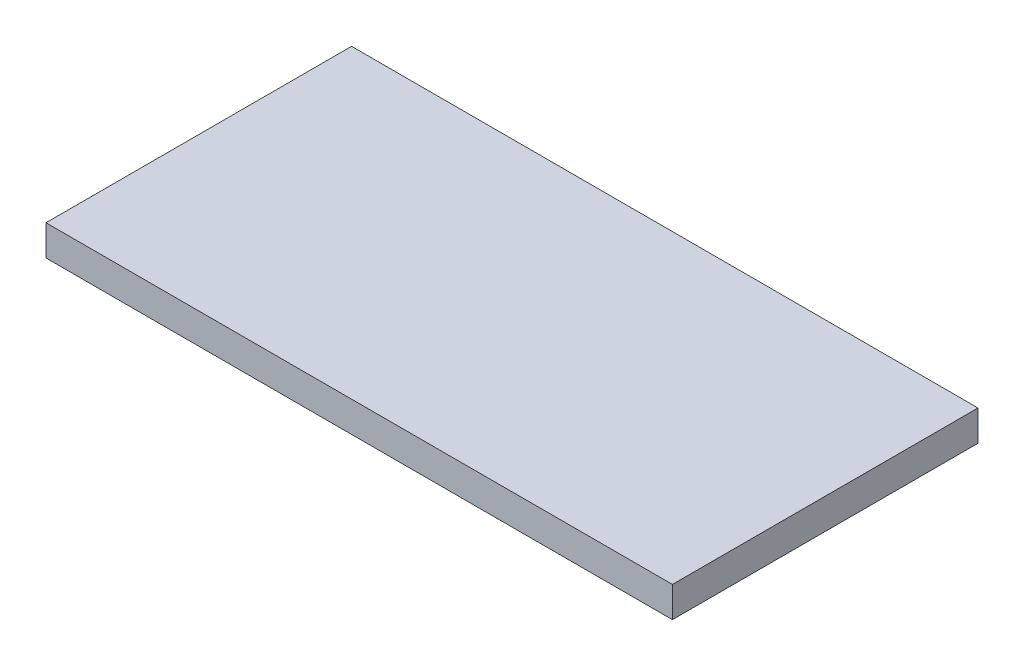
ISO-10303-21;
HEADER;
FILE_DESCRIPTION(('STEP AP214'),'2;1');
FILE_NAME('part.step','',(''),(''),'','','');
FILE_SCHEMA(('AUTOMOTIVE_DESIGN { 1 0 10303 214 1 1 1 1 }'));
ENDSEC;
DATA;
#1=APPLICATION_CONTEXT('core data for automotive mechanical design processes');
#2=APPLICATION_PROTOCOL_DEFINITION('international standard','automotive_design',2000,#1);
#3=PRODUCT_CONTEXT('',#1,'mechanical');
#4=PRODUCT('Part','Part','',(#3));
#5=PRODUCT_RELATED_PRODUCT_CATEGORY('part','',(#4));
#6=PRODUCT_DEFINITION_FORMATION('','',#4);
#7=PRODUCT_DEFINITION_CONTEXT('part definition',#1,'design');
#8=PRODUCT_DEFINITION('design','',#6,#7);
#9=PRODUCT_DEFINITION_SHAPE('','',#8);
#10=(LENGTH_UNIT() NAMED_UNIT(*) SI_UNIT(.MILLI.,.METRE.));
#11=(NAMED_UNIT(*) PLANE_ANGLE_UNIT() SI_UNIT($,.RADIAN.));
#12=(NAMED_UNIT(*) SI_UNIT($,.STERADIAN.) SOLID_ANGLE_UNIT());
#13=UNCERTAINTY_MEASURE_WITH_UNIT(LENGTH_MEASURE(1.E-05),#10,'distance_accuracy_value','');
#14=(GEOMETRIC_REPRESENTATION_CONTEXT(3) GLOBAL_UNCERTAINTY_ASSIGNED_CONTEXT((#13)) GLOBAL_UNIT_ASSIGNED_CONTEXT((#10,
#11,#12)) REPRESENTATION_CONTEXT('',''));
#15=CARTESIAN_POINT('',(0.,0.,0.));
#16=DIRECTION('',(0.,0.,1.));
#17=DIRECTION('',(1.,0.,0.));
#18=AXIS2_PLACEMENT_3D('',#15,#16,#17);
#19=CARTESIAN_POINT('',(-45.,0.,50.));
#20=DIRECTION('',(1.,0.,0.));
#21=DIRECTION('',(0.,0.,-1.));
#22=AXIS2_PLACEMENT_3D('',#19,#20,#21);
#23=PLANE('',#22);
#24=DIRECTION('',(0.,-1.,0.));
#25=VECTOR('',#24,1.);
#26=CARTESIAN_POINT('',(-45.,0.,-50.));
#27=LINE('',#26,#25);
#28=CARTESIAN_POINT('',(-45.,10.,-50.));
#29=VERTEX_POINT('',#28);
#30=CARTESIAN_POINT('',(-45.,0.,-50.));
#31=VERTEX_POINT('',#30);
#32=EDGE_CURVE('E106',#29,#31,#27,.T.);
#33=ORIENTED_EDGE('',*,*,#32,.T.);
#34=DIRECTION('',(0.,0.,-1.));
#35=VECTOR('',#34,1.);
#36=CARTESIAN_POINT('',(-45.,0.,50.));
#37=LINE('',#36,#35);
#38=CARTESIAN_POINT('',(-45.,0.,50.));
#39=VERTEX_POINT('',#38);
#40=EDGE_CURVE('E11',#39,#31,#37,.T.);
#41=ORIENTED_EDGE('',*,*,#40,.F.);
#42=DIRECTION('',(0.,-1.,0.));
#43=VECTOR('',#42,1.);
#44=CARTESIAN_POINT('',(-45.,0.,50.));
#45=LINE('',#44,#43);
#46=CARTESIAN_POINT('',(-45.,10.,50.));
#47=VERTEX_POINT('',#46);
#48=EDGE_CURVE('E94',#47,#39,#45,.T.);
#49=ORIENTED_EDGE('',*,*,#48,.F.);
#50=DIRECTION('',(0.,0.,-1.));
#51=VECTOR('',#50,1.);
#52=CARTESIAN_POINT('',(-45.,10.,50.));
#53=LINE('',#52,#51);
#54=EDGE_CURVE('E102',#47,#29,#53,.T.);
#55=ORIENTED_EDGE('',*,*,#54,.T.);
#56=EDGE_LOOP('',(#33,#41,#49,#55));
#57=FACE_BOUND('',#56,.T.);
#58=ADVANCED_FACE('F43',(#57),#23,.F.);
#59=CARTESIAN_POINT('',(-45.,0.,50.));
#60=DIRECTION('',(0.,1.,0.));
#61=DIRECTION('',(0.,0.,1.));
#62=AXIS2_PLACEMENT_3D('',#59,#60,#61);
#63=PLANE('',#62);
#64=DIRECTION('',(1.,0.,0.));
#65=VECTOR('',#64,1.);
#66=CARTESIAN_POINT('',(-45.,0.,-50.));
#67=LINE('',#66,#65);
#68=CARTESIAN_POINT('',(160.,0.,-50.));
#69=VERTEX_POINT('',#68);
#70=EDGE_CURVE('E98',#31,#69,#67,.T.);
#71=ORIENTED_EDGE('',*,*,#70,.T.);
#72=DIRECTION('',(0.,0.,-1.));
#73=VECTOR('',#72,1.);
#74=CARTESIAN_POINT('',(160.,0.,50.));
#75=LINE('',#74,#73);
#76=CARTESIAN_POINT('',(160.,0.,50.));
#77=VERTEX_POINT('',#76);
#78=EDGE_CURVE('E51',#77,#69,#75,.T.);
#79=ORIENTED_EDGE('',*,*,#78,.F.);
#80=DIRECTION('',(1.,0.,0.));
#81=VECTOR('',#80,1.);
#82=CARTESIAN_POINT('',(-45.,0.,50.));
#83=LINE('',#82,#81);
#84=EDGE_CURVE('E89',#39,#77,#83,.T.);
#85=ORIENTED_EDGE('',*,*,#84,.F.);
#86=ORIENTED_EDGE('',*,*,#40,.T.);
#87=EDGE_LOOP('',(#71,#79,#85,#86));
#88=FACE_BOUND('',#87,.T.);
#89=ADVANCED_FACE('F97',(#88),#63,.F.);
#90=CARTESIAN_POINT('',(160.,0.,50.));
#91=DIRECTION('',(-1.,0.,0.));
#92=DIRECTION('',(0.,0.,1.));
#93=AXIS2_PLACEMENT_3D('',#90,#91,#92);
#94=PLANE('',#93);
#95=DIRECTION('',(0.,1.,0.));
#96=VECTOR('',#95,1.);
#97=CARTESIAN_POINT('',(160.,0.,-50.));
#98=LINE('',#97,#96);
#99=CARTESIAN_POINT('',(160.,10.,-50.));
#100=VERTEX_POINT('',#99);
#101=EDGE_CURVE('E76',#69,#100,#98,.T.);
#102=ORIENTED_EDGE('',*,*,#101,.T.);
#103=DIRECTION('',(0.,0.,-1.));
#104=VECTOR('',#103,1.);
#105=CARTESIAN_POINT('',(160.,10.,50.));
#106=LINE('',#105,#104);
#107=CARTESIAN_POINT('',(160.,10.,50.));
#108=VERTEX_POINT('',#107);
#109=EDGE_CURVE('E99',#108,#100,#106,.T.);
#110=ORIENTED_EDGE('',*,*,#109,.F.);
#111=DIRECTION('',(0.,1.,0.));
#112=VECTOR('',#111,1.);
#113=CARTESIAN_POINT('',(160.,0.,50.));
#114=LINE('',#113,#112);
#115=EDGE_CURVE('E92',#77,#108,#114,.T.);
#116=ORIENTED_EDGE('',*,*,#115,.F.);
#117=ORIENTED_EDGE('',*,*,#78,.T.);
#118=EDGE_LOOP('',(#102,#110,#116,#117));
#119=FACE_BOUND('',#118,.T.);
#120=ADVANCED_FACE('F100',(#119),#94,.F.);
#121=CARTESIAN_POINT('',(-45.,10.,50.));
#122=DIRECTION('',(0.,-1.,0.));
#123=DIRECTION('',(0.,0.,-1.));
#124=AXIS2_PLACEMENT_3D('',#121,#122,#123);
#125=PLANE('',#124);
#126=DIRECTION('',(-1.,0.,0.));
#127=VECTOR('',#126,1.);
#128=CARTESIAN_POINT('',(-45.,10.,-50.));
#129=LINE('',#128,#127);
#130=EDGE_CURVE('E82',#100,#29,#129,.T.);
#131=ORIENTED_EDGE('',*,*,#130,.T.);
#132=ORIENTED_EDGE('',*,*,#54,.F.);
#133=DIRECTION('',(-1.,0.,0.));
#134=VECTOR('',#133,1.);
#135=CARTESIAN_POINT('',(-45.,10.,50.));
#136=LINE('',#135,#134);
#137=EDGE_CURVE('E59',#108,#47,#136,.T.);
#138=ORIENTED_EDGE('',*,*,#137,.F.);
#139=ORIENTED_EDGE('',*,*,#109,.T.);
#140=EDGE_LOOP('',(#131,#132,#138,#139));
#141=FACE_BOUND('',#140,.T.);
#142=ADVANCED_FACE('F113',(#141),#125,.F.);
#143=CARTESIAN_POINT('',(0.,0.,50.));
#144=DIRECTION('',(0.,0.,-1.));
#145=DIRECTION('',(-1.,0.,0.));
#146=AXIS2_PLACEMENT_3D('',#143,#144,#145);
#147=PLANE('',#146);
#148=ORIENTED_EDGE('',*,*,#48,.T.);
#149=ORIENTED_EDGE('',*,*,#84,.T.);
#150=ORIENTED_EDGE('',*,*,#115,.T.);
#151=ORIENTED_EDGE('',*,*,#137,.T.);
#152=EDGE_LOOP('',(#148,#149,#150,#151));
#153=FACE_BOUND('',#152,.T.);
#154=ADVANCED_FACE('F90',(#153),#147,.F.);
#155=CARTESIAN_POINT('',(0.,0.,-50.));
#156=DIRECTION('',(0.,0.,-1.));
#157=DIRECTION('',(-1.,0.,0.));
#158=AXIS2_PLACEMENT_3D('',#155,#156,#157);
#159=PLANE('',#158);
#160=ORIENTED_EDGE('',*,*,#32,.F.);
#161=ORIENTED_EDGE('',*,*,#130,.F.);
#162=ORIENTED_EDGE('',*,*,#101,.F.);
#163=ORIENTED_EDGE('',*,*,#70,.F.);
#164=EDGE_LOOP('',(#160,#161,#162,#163));
#165=FACE_BOUND('',#164,.T.);
#166=ADVANCED_FACE('F116',(#165),#159,.T.);
#167=CLOSED_SHELL('',(#58,#89,#120,#142,#154,#166));
#168=MANIFOLD_SOLID_BREP('B2',#167);
#169=ADVANCED_BREP_SHAPE_REPRESENTATION('',(#18,#168),#14);
#170=SHAPE_DEFINITION_REPRESENTATION(#9,#169);
ENDSEC;
END-ISO-10303-21;
